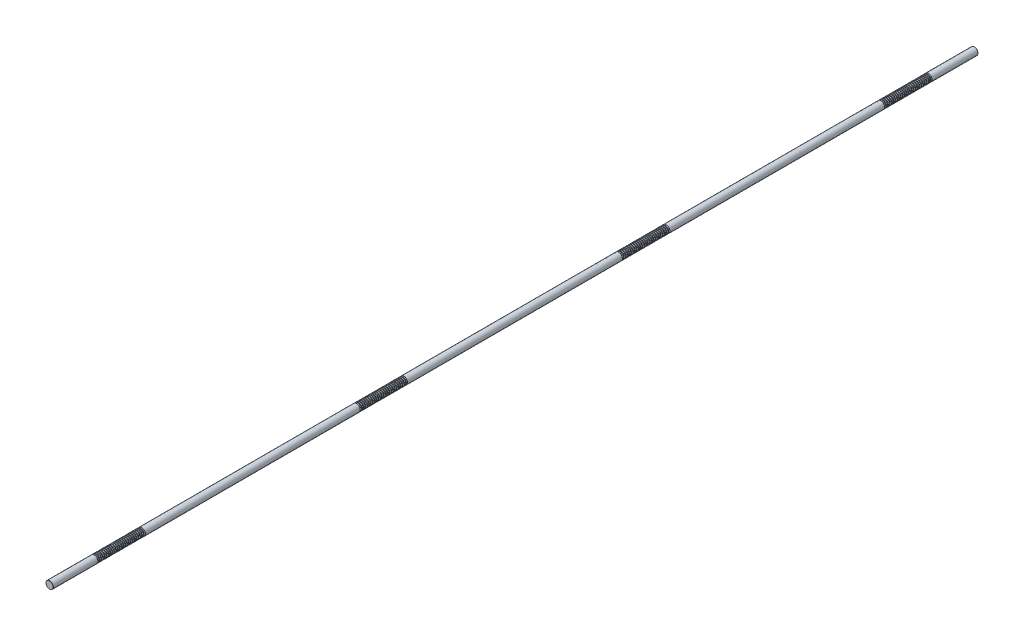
from build123d import *

# Parameters (mm, degrees)
SKETCH1_R           = 8
BOSS_EXTRUDE1_DEPTH = 1000
CHAMFER1_SIZE       = 0.4
LPATTERN1_COUNT     = 26
LPATTERN1_PITCH     = 4
LPATTERN2_COUNT     = 4
LPATTERN2_PITCH     = 567


with BuildPart() as part:
    # Sketch1 → Boss-Extrude1 (new, symmetric)
    with BuildSketch(Plane.XY):
        Circle(SKETCH1_R)
    extrude(amount=BOSS_EXTRUDE1_DEPTH, both=True)

    # Chamfer1
    chamfer1_edges = [part.edges().sort_by_distance(p)[0] for p in [
        (-8, 0, -1000),
        (-8, 0, 1000),
    ]]
    chamfer(chamfer1_edges, length=CHAMFER1_SIZE)

    # Sketch2 → Cut-Revolve1 (revolve, cut)
    with BuildSketch(Plane(origin=(0, 0, 0), x_dir=(0, 0, -1), z_dir=(1, 0, 0)), mode=Mode.PRIVATE) as cut_revolve1_sk:
        Polygon((900.301442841, 8), (897.698557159, 8), (898.301442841, 5.75), (899.698557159, 5.75), align=None)
    cut_revolve1 = revolve(cut_revolve1_sk.sketch.rotate(Axis((0, 0, 1000), (0, 0, -1)), 90), axis=Axis((0, 0, 1000), (0, 0, -1)), mode=Mode.SUBTRACT)

    # LPattern1: Cut-Revolve1 ×26
    with Locations(*[(0, 0, i * LPATTERN1_PITCH) for i in range(1, LPATTERN1_COUNT)]):
        add(cut_revolve1, mode=Mode.SUBTRACT)

    # LPattern2: Cut-Revolve1 ×4
    with Locations(*[(0, 0, i * LPATTERN2_PITCH) for i in range(1, LPATTERN2_COUNT)]):
        add(cut_revolve1, mode=Mode.SUBTRACT)

    # LPattern2 copy 1 sketch → LPattern2 copy 1 (revolve, cut)
    with BuildSketch(Plane(origin=(0, 0, 571), x_dir=(0, 0, -1), z_dir=(1, 0, 0))):
        Polygon((900.301442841, 8), (897.698557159, 8), (898.301442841, 5.75), (899.698557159, 5.75), align=None)
    revolve(axis=Axis((0, 0, 1571), (0, 0, -1)), mode=Mode.SUBTRACT)

    # LPattern2 copy 2 sketch → LPattern2 copy 2 (revolve, cut)
    with BuildSketch(Plane(origin=(0, 0, 1138), x_dir=(0, 0, -1), z_dir=(1, 0, 0))):
        Polygon((900.301442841, 8), (897.698557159, 8), (898.301442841, 5.75), (899.698557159, 5.75), align=None)
    revolve(axis=Axis((0, 0, 2138), (0, 0, -1)), mode=Mode.SUBTRACT)

    # LPattern2 copy 3 sketch → LPattern2 copy 3 (revolve, cut)
    with BuildSketch(Plane(origin=(0, 0, 1705), x_dir=(0, 0, -1), z_dir=(1, 0, 0))):
        Polygon((900.301442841, 8), (897.698557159, 8), (898.301442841, 5.75), (899.698557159, 5.75), align=None)
    revolve(axis=Axis((0, 0, 2705), (0, 0, -1)), mode=Mode.SUBTRACT)

    # LPattern2 copy 4 sketch → LPattern2 copy 4 (revolve, cut)
    with BuildSketch(Plane(origin=(0, 0, 575), x_dir=(0, 0, -1), z_dir=(1, 0, 0))):
        Polygon((900.301442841, 8), (897.698557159, 8), (898.301442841, 5.75), (899.698557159, 5.75), align=None)
    revolve(axis=Axis((0, 0, 1575), (0, 0, -1)), mode=Mode.SUBTRACT)

    # LPattern2 copy 5 sketch → LPattern2 copy 5 (revolve, cut)
    with BuildSketch(Plane(origin=(0, 0, 1142), x_dir=(0, 0, -1), z_dir=(1, 0, 0))):
        Polygon((900.301442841, 8), (897.698557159, 8), (898.301442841, 5.75), (899.698557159, 5.75), align=None)
    revolve(axis=Axis((0, 0, 2142), (0, 0, -1)), mode=Mode.SUBTRACT)

    # LPattern2 copy 6 sketch → LPattern2 copy 6 (revolve, cut)
    with BuildSketch(Plane(origin=(0, 0, 1709), x_dir=(0, 0, -1), z_dir=(1, 0, 0))):
        Polygon((900.301442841, 8), (897.698557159, 8), (898.301442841, 5.75), (899.698557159, 5.75), align=None)
    revolve(axis=Axis((0, 0, 2709), (0, 0, -1)), mode=Mode.SUBTRACT)

    # LPattern2 copy 7 sketch → LPattern2 copy 7 (revolve, cut)
    with BuildSketch(Plane(origin=(0, 0, 579), x_dir=(0, 0, -1), z_dir=(1, 0, 0))):
        Polygon((900.301442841, 8), (897.698557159, 8), (898.301442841, 5.75), (899.698557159, 5.75), align=None)
    revolve(axis=Axis((0, 0, 1579), (0, 0, -1)), mode=Mode.SUBTRACT)

    # LPattern2 copy 8 sketch → LPattern2 copy 8 (revolve, cut)
    with BuildSketch(Plane(origin=(0, 0, 1146), x_dir=(0, 0, -1), z_dir=(1, 0, 0))):
        Polygon((900.301442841, 8), (897.698557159, 8), (898.301442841, 5.75), (899.698557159, 5.75), align=None)
    revolve(axis=Axis((0, 0, 2146), (0, 0, -1)), mode=Mode.SUBTRACT)

    # LPattern2 copy 9 sketch → LPattern2 copy 9 (revolve, cut)
    with BuildSketch(Plane(origin=(0, 0, 1713), x_dir=(0, 0, -1), z_dir=(1, 0, 0))):
        Polygon((900.301442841, 8), (897.698557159, 8), (898.301442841, 5.75), (899.698557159, 5.75), align=None)
    revolve(axis=Axis((0, 0, 2713), (0, 0, -1)), mode=Mode.SUBTRACT)

    # LPattern2 copy 10 sketch → LPattern2 copy 10 (revolve, cut)
    with BuildSketch(Plane(origin=(0, 0, 583), x_dir=(0, 0, -1), z_dir=(1, 0, 0))):
        Polygon((900.301442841, 8), (897.698557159, 8), (898.301442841, 5.75), (899.698557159, 5.75), align=None)
    revolve(axis=Axis((0, 0, 1583), (0, 0, -1)), mode=Mode.SUBTRACT)

    # LPattern2 copy 11 sketch → LPattern2 copy 11 (revolve, cut)
    with BuildSketch(Plane(origin=(0, 0, 1150), x_dir=(0, 0, -1), z_dir=(1, 0, 0))):
        Polygon((900.301442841, 8), (897.698557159, 8), (898.301442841, 5.75), (899.698557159, 5.75), align=None)
    revolve(axis=Axis((0, 0, 2150), (0, 0, -1)), mode=Mode.SUBTRACT)

    # LPattern2 copy 12 sketch → LPattern2 copy 12 (revolve, cut)
    with BuildSketch(Plane(origin=(0, 0, 1717), x_dir=(0, 0, -1), z_dir=(1, 0, 0))):
        Polygon((900.301442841, 8), (897.698557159, 8), (898.301442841, 5.75), (899.698557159, 5.75), align=None)
    revolve(axis=Axis((0, 0, 2717), (0, 0, -1)), mode=Mode.SUBTRACT)

    # LPattern2 copy 13 sketch → LPattern2 copy 13 (revolve, cut)
    with BuildSketch(Plane(origin=(0, 0, 587), x_dir=(0, 0, -1), z_dir=(1, 0, 0))):
        Polygon((900.301442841, 8), (897.698557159, 8), (898.301442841, 5.75), (899.698557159, 5.75), align=None)
    revolve(axis=Axis((0, 0, 1587), (0, 0, -1)), mode=Mode.SUBTRACT)

    # LPattern2 copy 14 sketch → LPattern2 copy 14 (revolve, cut)
    with BuildSketch(Plane(origin=(0, 0, 1154), x_dir=(0, 0, -1), z_dir=(1, 0, 0))):
        Polygon((900.301442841, 8), (897.698557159, 8), (898.301442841, 5.75), (899.698557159, 5.75), align=None)
    revolve(axis=Axis((0, 0, 2154), (0, 0, -1)), mode=Mode.SUBTRACT)

    # LPattern2 copy 15 sketch → LPattern2 copy 15 (revolve, cut)
    with BuildSketch(Plane(origin=(0, 0, 1721), x_dir=(0, 0, -1), z_dir=(1, 0, 0))):
        Polygon((900.301442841, 8), (897.698557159, 8), (898.301442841, 5.75), (899.698557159, 5.75), align=None)
    revolve(axis=Axis((0, 0, 2721), (0, 0, -1)), mode=Mode.SUBTRACT)

    # LPattern2 copy 16 sketch → LPattern2 copy 16 (revolve, cut)
    with BuildSketch(Plane(origin=(0, 0, 591), x_dir=(0, 0, -1), z_dir=(1, 0, 0))):
        Polygon((900.301442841, 8), (897.698557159, 8), (898.301442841, 5.75), (899.698557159, 5.75), align=None)
    revolve(axis=Axis((0, 0, 1591), (0, 0, -1)), mode=Mode.SUBTRACT)

    # LPattern2 copy 17 sketch → LPattern2 copy 17 (revolve, cut)
    with BuildSketch(Plane(origin=(0, 0, 1158), x_dir=(0, 0, -1), z_dir=(1, 0, 0))):
        Polygon((900.301442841, 8), (897.698557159, 8), (898.301442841, 5.75), (899.698557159, 5.75), align=None)
    revolve(axis=Axis((0, 0, 2158), (0, 0, -1)), mode=Mode.SUBTRACT)

    # LPattern2 copy 18 sketch → LPattern2 copy 18 (revolve, cut)
    with BuildSketch(Plane(origin=(0, 0, 1725), x_dir=(0, 0, -1), z_dir=(1, 0, 0))):
        Polygon((900.301442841, 8), (897.698557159, 8), (898.301442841, 5.75), (899.698557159, 5.75), align=None)
    revolve(axis=Axis((0, 0, 2725), (0, 0, -1)), mode=Mode.SUBTRACT)

    # LPattern2 copy 19 sketch → LPattern2 copy 19 (revolve, cut)
    with BuildSketch(Plane(origin=(0, 0, 595), x_dir=(0, 0, -1), z_dir=(1, 0, 0))):
        Polygon((900.301442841, 8), (897.698557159, 8), (898.301442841, 5.75), (899.698557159, 5.75), align=None)
    revolve(axis=Axis((0, 0, 1595), (0, 0, -1)), mode=Mode.SUBTRACT)

    # LPattern2 copy 20 sketch → LPattern2 copy 20 (revolve, cut)
    with BuildSketch(Plane(origin=(0, 0, 1162), x_dir=(0, 0, -1), z_dir=(1, 0, 0))):
        Polygon((900.301442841, 8), (897.698557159, 8), (898.301442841, 5.75), (899.698557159, 5.75), align=None)
    revolve(axis=Axis((0, 0, 2162), (0, 0, -1)), mode=Mode.SUBTRACT)

    # LPattern2 copy 21 sketch → LPattern2 copy 21 (revolve, cut)
    with BuildSketch(Plane(origin=(0, 0, 1729), x_dir=(0, 0, -1), z_dir=(1, 0, 0))):
        Polygon((900.301442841, 8), (897.698557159, 8), (898.301442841, 5.75), (899.698557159, 5.75), align=None)
    revolve(axis=Axis((0, 0, 2729), (0, 0, -1)), mode=Mode.SUBTRACT)

    # LPattern2 copy 22 sketch → LPattern2 copy 22 (revolve, cut)
    with BuildSketch(Plane(origin=(0, 0, 599), x_dir=(0, 0, -1), z_dir=(1, 0, 0))):
        Polygon((900.301442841, 8), (897.698557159, 8), (898.301442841, 5.75), (899.698557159, 5.75), align=None)
    revolve(axis=Axis((0, 0, 1599), (0, 0, -1)), mode=Mode.SUBTRACT)

    # LPattern2 copy 23 sketch → LPattern2 copy 23 (revolve, cut)
    with BuildSketch(Plane(origin=(0, 0, 1166), x_dir=(0, 0, -1), z_dir=(1, 0, 0))):
        Polygon((900.301442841, 8), (897.698557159, 8), (898.301442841, 5.75), (899.698557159, 5.75), align=None)
    revolve(axis=Axis((0, 0, 2166), (0, 0, -1)), mode=Mode.SUBTRACT)

    # LPattern2 copy 24 sketch → LPattern2 copy 24 (revolve, cut)
    with BuildSketch(Plane(origin=(0, 0, 1733), x_dir=(0, 0, -1), z_dir=(1, 0, 0))):
        Polygon((900.301442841, 8), (897.698557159, 8), (898.301442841, 5.75), (899.698557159, 5.75), align=None)
    revolve(axis=Axis((0, 0, 2733), (0, 0, -1)), mode=Mode.SUBTRACT)

    # LPattern2 copy 25 sketch → LPattern2 copy 25 (revolve, cut)
    with BuildSketch(Plane(origin=(0, 0, 603), x_dir=(0, 0, -1), z_dir=(1, 0, 0))):
        Polygon((900.301442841, 8), (897.698557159, 8), (898.301442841, 5.75), (899.698557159, 5.75), align=None)
    revolve(axis=Axis((0, 0, 1603), (0, 0, -1)), mode=Mode.SUBTRACT)

    # LPattern2 copy 26 sketch → LPattern2 copy 26 (revolve, cut)
    with BuildSketch(Plane(origin=(0, 0, 1170), x_dir=(0, 0, -1), z_dir=(1, 0, 0))):
        Polygon((900.301442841, 8), (897.698557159, 8), (898.301442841, 5.75), (899.698557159, 5.75), align=None)
    revolve(axis=Axis((0, 0, 2170), (0, 0, -1)), mode=Mode.SUBTRACT)

    # LPattern2 copy 27 sketch → LPattern2 copy 27 (revolve, cut)
    with BuildSketch(Plane(origin=(0, 0, 1737), x_dir=(0, 0, -1), z_dir=(1, 0, 0))):
        Polygon((900.301442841, 8), (897.698557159, 8), (898.301442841, 5.75), (899.698557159, 5.75), align=None)
    revolve(axis=Axis((0, 0, 2737), (0, 0, -1)), mode=Mode.SUBTRACT)

    # LPattern2 copy 28 sketch → LPattern2 copy 28 (revolve, cut)
    with BuildSketch(Plane(origin=(0, 0, 607), x_dir=(0, 0, -1), z_dir=(1, 0, 0))):
        Polygon((900.301442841, 8), (897.698557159, 8), (898.301442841, 5.75), (899.698557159, 5.75), align=None)
    revolve(axis=Axis((0, 0, 1607), (0, 0, -1)), mode=Mode.SUBTRACT)

    # LPattern2 copy 29 sketch → LPattern2 copy 29 (revolve, cut)
    with BuildSketch(Plane(origin=(0, 0, 1174), x_dir=(0, 0, -1), z_dir=(1, 0, 0))):
        Polygon((900.301442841, 8), (897.698557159, 8), (898.301442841, 5.75), (899.698557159, 5.75), align=None)
    revolve(axis=Axis((0, 0, 2174), (0, 0, -1)), mode=Mode.SUBTRACT)

    # LPattern2 copy 30 sketch → LPattern2 copy 30 (revolve, cut)
    with BuildSketch(Plane(origin=(0, 0, 1741), x_dir=(0, 0, -1), z_dir=(1, 0, 0))):
        Polygon((900.301442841, 8), (897.698557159, 8), (898.301442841, 5.75), (899.698557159, 5.75), align=None)
    revolve(axis=Axis((0, 0, 2741), (0, 0, -1)), mode=Mode.SUBTRACT)

    # LPattern2 copy 31 sketch → LPattern2 copy 31 (revolve, cut)
    with BuildSketch(Plane(origin=(0, 0, 611), x_dir=(0, 0, -1), z_dir=(1, 0, 0))):
        Polygon((900.301442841, 8), (897.698557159, 8), (898.301442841, 5.75), (899.698557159, 5.75), align=None)
    revolve(axis=Axis((0, 0, 1611), (0, 0, -1)), mode=Mode.SUBTRACT)

    # LPattern2 copy 32 sketch → LPattern2 copy 32 (revolve, cut)
    with BuildSketch(Plane(origin=(0, 0, 1178), x_dir=(0, 0, -1), z_dir=(1, 0, 0))):
        Polygon((900.301442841, 8), (897.698557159, 8), (898.301442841, 5.75), (899.698557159, 5.75), align=None)
    revolve(axis=Axis((0, 0, 2178), (0, 0, -1)), mode=Mode.SUBTRACT)

    # LPattern2 copy 33 sketch → LPattern2 copy 33 (revolve, cut)
    with BuildSketch(Plane(origin=(0, 0, 1745), x_dir=(0, 0, -1), z_dir=(1, 0, 0))):
        Polygon((900.301442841, 8), (897.698557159, 8), (898.301442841, 5.75), (899.698557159, 5.75), align=None)
    revolve(axis=Axis((0, 0, 2745), (0, 0, -1)), mode=Mode.SUBTRACT)

    # LPattern2 copy 34 sketch → LPattern2 copy 34 (revolve, cut)
    with BuildSketch(Plane(origin=(0, 0, 615), x_dir=(0, 0, -1), z_dir=(1, 0, 0))):
        Polygon((900.301442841, 8), (897.698557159, 8), (898.301442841, 5.75), (899.698557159, 5.75), align=None)
    revolve(axis=Axis((0, 0, 1615), (0, 0, -1)), mode=Mode.SUBTRACT)

    # LPattern2 copy 35 sketch → LPattern2 copy 35 (revolve, cut)
    with BuildSketch(Plane(origin=(0, 0, 1182), x_dir=(0, 0, -1), z_dir=(1, 0, 0))):
        Polygon((900.301442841, 8), (897.698557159, 8), (898.301442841, 5.75), (899.698557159, 5.75), align=None)
    revolve(axis=Axis((0, 0, 2182), (0, 0, -1)), mode=Mode.SUBTRACT)

    # LPattern2 copy 36 sketch → LPattern2 copy 36 (revolve, cut)
    with BuildSketch(Plane(origin=(0, 0, 1749), x_dir=(0, 0, -1), z_dir=(1, 0, 0))):
        Polygon((900.301442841, 8), (897.698557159, 8), (898.301442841, 5.75), (899.698557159, 5.75), align=None)
    revolve(axis=Axis((0, 0, 2749), (0, 0, -1)), mode=Mode.SUBTRACT)

    # LPattern2 copy 37 sketch → LPattern2 copy 37 (revolve, cut)
    with BuildSketch(Plane(origin=(0, 0, 619), x_dir=(0, 0, -1), z_dir=(1, 0, 0))):
        Polygon((900.301442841, 8), (897.698557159, 8), (898.301442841, 5.75), (899.698557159, 5.75), align=None)
    revolve(axis=Axis((0, 0, 1619), (0, 0, -1)), mode=Mode.SUBTRACT)

    # LPattern2 copy 38 sketch → LPattern2 copy 38 (revolve, cut)
    with BuildSketch(Plane(origin=(0, 0, 1186), x_dir=(0, 0, -1), z_dir=(1, 0, 0))):
        Polygon((900.301442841, 8), (897.698557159, 8), (898.301442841, 5.75), (899.698557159, 5.75), align=None)
    revolve(axis=Axis((0, 0, 2186), (0, 0, -1)), mode=Mode.SUBTRACT)

    # LPattern2 copy 39 sketch → LPattern2 copy 39 (revolve, cut)
    with BuildSketch(Plane(origin=(0, 0, 1753), x_dir=(0, 0, -1), z_dir=(1, 0, 0))):
        Polygon((900.301442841, 8), (897.698557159, 8), (898.301442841, 5.75), (899.698557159, 5.75), align=None)
    revolve(axis=Axis((0, 0, 2753), (0, 0, -1)), mode=Mode.SUBTRACT)

    # LPattern2 copy 40 sketch → LPattern2 copy 40 (revolve, cut)
    with BuildSketch(Plane(origin=(0, 0, 623), x_dir=(0, 0, -1), z_dir=(1, 0, 0))):
        Polygon((900.301442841, 8), (897.698557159, 8), (898.301442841, 5.75), (899.698557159, 5.75), align=None)
    revolve(axis=Axis((0, 0, 1623), (0, 0, -1)), mode=Mode.SUBTRACT)

    # LPattern2 copy 41 sketch → LPattern2 copy 41 (revolve, cut)
    with BuildSketch(Plane(origin=(0, 0, 1190), x_dir=(0, 0, -1), z_dir=(1, 0, 0))):
        Polygon((900.301442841, 8), (897.698557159, 8), (898.301442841, 5.75), (899.698557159, 5.75), align=None)
    revolve(axis=Axis((0, 0, 2190), (0, 0, -1)), mode=Mode.SUBTRACT)

    # LPattern2 copy 42 sketch → LPattern2 copy 42 (revolve, cut)
    with BuildSketch(Plane(origin=(0, 0, 1757), x_dir=(0, 0, -1), z_dir=(1, 0, 0))):
        Polygon((900.301442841, 8), (897.698557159, 8), (898.301442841, 5.75), (899.698557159, 5.75), align=None)
    revolve(axis=Axis((0, 0, 2757), (0, 0, -1)), mode=Mode.SUBTRACT)

    # LPattern2 copy 43 sketch → LPattern2 copy 43 (revolve, cut)
    with BuildSketch(Plane(origin=(0, 0, 627), x_dir=(0, 0, -1), z_dir=(1, 0, 0))):
        Polygon((900.301442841, 8), (897.698557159, 8), (898.301442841, 5.75), (899.698557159, 5.75), align=None)
    revolve(axis=Axis((0, 0, 1627), (0, 0, -1)), mode=Mode.SUBTRACT)

    # LPattern2 copy 44 sketch → LPattern2 copy 44 (revolve, cut)
    with BuildSketch(Plane(origin=(0, 0, 1194), x_dir=(0, 0, -1), z_dir=(1, 0, 0))):
        Polygon((900.301442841, 8), (897.698557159, 8), (898.301442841, 5.75), (899.698557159, 5.75), align=None)
    revolve(axis=Axis((0, 0, 2194), (0, 0, -1)), mode=Mode.SUBTRACT)

    # LPattern2 copy 45 sketch → LPattern2 copy 45 (revolve, cut)
    with BuildSketch(Plane(origin=(0, 0, 1761), x_dir=(0, 0, -1), z_dir=(1, 0, 0))):
        Polygon((900.301442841, 8), (897.698557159, 8), (898.301442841, 5.75), (899.698557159, 5.75), align=None)
    revolve(axis=Axis((0, 0, 2761), (0, 0, -1)), mode=Mode.SUBTRACT)

    # LPattern2 copy 46 sketch → LPattern2 copy 46 (revolve, cut)
    with BuildSketch(Plane(origin=(0, 0, 631), x_dir=(0, 0, -1), z_dir=(1, 0, 0))):
        Polygon((900.301442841, 8), (897.698557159, 8), (898.301442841, 5.75), (899.698557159, 5.75), align=None)
    revolve(axis=Axis((0, 0, 1631), (0, 0, -1)), mode=Mode.SUBTRACT)

    # LPattern2 copy 47 sketch → LPattern2 copy 47 (revolve, cut)
    with BuildSketch(Plane(origin=(0, 0, 1198), x_dir=(0, 0, -1), z_dir=(1, 0, 0))):
        Polygon((900.301442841, 8), (897.698557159, 8), (898.301442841, 5.75), (899.698557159, 5.75), align=None)
    revolve(axis=Axis((0, 0, 2198), (0, 0, -1)), mode=Mode.SUBTRACT)

    # LPattern2 copy 48 sketch → LPattern2 copy 48 (revolve, cut)
    with BuildSketch(Plane(origin=(0, 0, 1765), x_dir=(0, 0, -1), z_dir=(1, 0, 0))):
        Polygon((900.301442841, 8), (897.698557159, 8), (898.301442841, 5.75), (899.698557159, 5.75), align=None)
    revolve(axis=Axis((0, 0, 2765), (0, 0, -1)), mode=Mode.SUBTRACT)

    # LPattern2 copy 49 sketch → LPattern2 copy 49 (revolve, cut)
    with BuildSketch(Plane(origin=(0, 0, 635), x_dir=(0, 0, -1), z_dir=(1, 0, 0))):
        Polygon((900.301442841, 8), (897.698557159, 8), (898.301442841, 5.75), (899.698557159, 5.75), align=None)
    revolve(axis=Axis((0, 0, 1635), (0, 0, -1)), mode=Mode.SUBTRACT)

    # LPattern2 copy 50 sketch → LPattern2 copy 50 (revolve, cut)
    with BuildSketch(Plane(origin=(0, 0, 1202), x_dir=(0, 0, -1), z_dir=(1, 0, 0))):
        Polygon((900.301442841, 8), (897.698557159, 8), (898.301442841, 5.75), (899.698557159, 5.75), align=None)
    revolve(axis=Axis((0, 0, 2202), (0, 0, -1)), mode=Mode.SUBTRACT)

    # LPattern2 copy 51 sketch → LPattern2 copy 51 (revolve, cut)
    with BuildSketch(Plane(origin=(0, 0, 1769), x_dir=(0, 0, -1), z_dir=(1, 0, 0))):
        Polygon((900.301442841, 8), (897.698557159, 8), (898.301442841, 5.75), (899.698557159, 5.75), align=None)
    revolve(axis=Axis((0, 0, 2769), (0, 0, -1)), mode=Mode.SUBTRACT)

    # LPattern2 copy 52 sketch → LPattern2 copy 52 (revolve, cut)
    with BuildSketch(Plane(origin=(0, 0, 639), x_dir=(0, 0, -1), z_dir=(1, 0, 0))):
        Polygon((900.301442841, 8), (897.698557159, 8), (898.301442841, 5.75), (899.698557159, 5.75), align=None)
    revolve(axis=Axis((0, 0, 1639), (0, 0, -1)), mode=Mode.SUBTRACT)

    # LPattern2 copy 53 sketch → LPattern2 copy 53 (revolve, cut)
    with BuildSketch(Plane(origin=(0, 0, 1206), x_dir=(0, 0, -1), z_dir=(1, 0, 0))):
        Polygon((900.301442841, 8), (897.698557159, 8), (898.301442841, 5.75), (899.698557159, 5.75), align=None)
    revolve(axis=Axis((0, 0, 2206), (0, 0, -1)), mode=Mode.SUBTRACT)

    # LPattern2 copy 54 sketch → LPattern2 copy 54 (revolve, cut)
    with BuildSketch(Plane(origin=(0, 0, 1773), x_dir=(0, 0, -1), z_dir=(1, 0, 0))):
        Polygon((900.301442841, 8), (897.698557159, 8), (898.301442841, 5.75), (899.698557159, 5.75), align=None)
    revolve(axis=Axis((0, 0, 2773), (0, 0, -1)), mode=Mode.SUBTRACT)

    # LPattern2 copy 55 sketch → LPattern2 copy 55 (revolve, cut)
    with BuildSketch(Plane(origin=(0, 0, 643), x_dir=(0, 0, -1), z_dir=(1, 0, 0))):
        Polygon((900.301442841, 8), (897.698557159, 8), (898.301442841, 5.75), (899.698557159, 5.75), align=None)
    revolve(axis=Axis((0, 0, 1643), (0, 0, -1)), mode=Mode.SUBTRACT)

    # LPattern2 copy 56 sketch → LPattern2 copy 56 (revolve, cut)
    with BuildSketch(Plane(origin=(0, 0, 1210), x_dir=(0, 0, -1), z_dir=(1, 0, 0))):
        Polygon((900.301442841, 8), (897.698557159, 8), (898.301442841, 5.75), (899.698557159, 5.75), align=None)
    revolve(axis=Axis((0, 0, 2210), (0, 0, -1)), mode=Mode.SUBTRACT)

    # LPattern2 copy 57 sketch → LPattern2 copy 57 (revolve, cut)
    with BuildSketch(Plane(origin=(0, 0, 1777), x_dir=(0, 0, -1), z_dir=(1, 0, 0))):
        Polygon((900.301442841, 8), (897.698557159, 8), (898.301442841, 5.75), (899.698557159, 5.75), align=None)
    revolve(axis=Axis((0, 0, 2777), (0, 0, -1)), mode=Mode.SUBTRACT)

    # LPattern2 copy 58 sketch → LPattern2 copy 58 (revolve, cut)
    with BuildSketch(Plane(origin=(0, 0, 647), x_dir=(0, 0, -1), z_dir=(1, 0, 0))):
        Polygon((900.301442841, 8), (897.698557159, 8), (898.301442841, 5.75), (899.698557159, 5.75), align=None)
    revolve(axis=Axis((0, 0, 1647), (0, 0, -1)), mode=Mode.SUBTRACT)

    # LPattern2 copy 59 sketch → LPattern2 copy 59 (revolve, cut)
    with BuildSketch(Plane(origin=(0, 0, 1214), x_dir=(0, 0, -1), z_dir=(1, 0, 0))):
        Polygon((900.301442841, 8), (897.698557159, 8), (898.301442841, 5.75), (899.698557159, 5.75), align=None)
    revolve(axis=Axis((0, 0, 2214), (0, 0, -1)), mode=Mode.SUBTRACT)

    # LPattern2 copy 60 sketch → LPattern2 copy 60 (revolve, cut)
    with BuildSketch(Plane(origin=(0, 0, 1781), x_dir=(0, 0, -1), z_dir=(1, 0, 0))):
        Polygon((900.301442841, 8), (897.698557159, 8), (898.301442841, 5.75), (899.698557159, 5.75), align=None)
    revolve(axis=Axis((0, 0, 2781), (0, 0, -1)), mode=Mode.SUBTRACT)

    # LPattern2 copy 61 sketch → LPattern2 copy 61 (revolve, cut)
    with BuildSketch(Plane(origin=(0, 0, 651), x_dir=(0, 0, -1), z_dir=(1, 0, 0))):
        Polygon((900.301442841, 8), (897.698557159, 8), (898.301442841, 5.75), (899.698557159, 5.75), align=None)
    revolve(axis=Axis((0, 0, 1651), (0, 0, -1)), mode=Mode.SUBTRACT)

    # LPattern2 copy 62 sketch → LPattern2 copy 62 (revolve, cut)
    with BuildSketch(Plane(origin=(0, 0, 1218), x_dir=(0, 0, -1), z_dir=(1, 0, 0))):
        Polygon((900.301442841, 8), (897.698557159, 8), (898.301442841, 5.75), (899.698557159, 5.75), align=None)
    revolve(axis=Axis((0, 0, 2218), (0, 0, -1)), mode=Mode.SUBTRACT)

    # LPattern2 copy 63 sketch → LPattern2 copy 63 (revolve, cut)
    with BuildSketch(Plane(origin=(0, 0, 1785), x_dir=(0, 0, -1), z_dir=(1, 0, 0))):
        Polygon((900.301442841, 8), (897.698557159, 8), (898.301442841, 5.75), (899.698557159, 5.75), align=None)
    revolve(axis=Axis((0, 0, 2785), (0, 0, -1)), mode=Mode.SUBTRACT)

    # LPattern2 copy 64 sketch → LPattern2 copy 64 (revolve, cut)
    with BuildSketch(Plane(origin=(0, 0, 655), x_dir=(0, 0, -1), z_dir=(1, 0, 0))):
        Polygon((900.301442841, 8), (897.698557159, 8), (898.301442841, 5.75), (899.698557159, 5.75), align=None)
    revolve(axis=Axis((0, 0, 1655), (0, 0, -1)), mode=Mode.SUBTRACT)

    # LPattern2 copy 65 sketch → LPattern2 copy 65 (revolve, cut)
    with BuildSketch(Plane(origin=(0, 0, 1222), x_dir=(0, 0, -1), z_dir=(1, 0, 0))):
        Polygon((900.301442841, 8), (897.698557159, 8), (898.301442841, 5.75), (899.698557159, 5.75), align=None)
    revolve(axis=Axis((0, 0, 2222), (0, 0, -1)), mode=Mode.SUBTRACT)

    # LPattern2 copy 66 sketch → LPattern2 copy 66 (revolve, cut)
    with BuildSketch(Plane(origin=(0, 0, 1789), x_dir=(0, 0, -1), z_dir=(1, 0, 0))):
        Polygon((900.301442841, 8), (897.698557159, 8), (898.301442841, 5.75), (899.698557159, 5.75), align=None)
    revolve(axis=Axis((0, 0, 2789), (0, 0, -1)), mode=Mode.SUBTRACT)

    # LPattern2 copy 67 sketch → LPattern2 copy 67 (revolve, cut)
    with BuildSketch(Plane(origin=(0, 0, 659), x_dir=(0, 0, -1), z_dir=(1, 0, 0))):
        Polygon((900.301442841, 8), (897.698557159, 8), (898.301442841, 5.75), (899.698557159, 5.75), align=None)
    revolve(axis=Axis((0, 0, 1659), (0, 0, -1)), mode=Mode.SUBTRACT)

    # LPattern2 copy 68 sketch → LPattern2 copy 68 (revolve, cut)
    with BuildSketch(Plane(origin=(0, 0, 1226), x_dir=(0, 0, -1), z_dir=(1, 0, 0))):
        Polygon((900.301442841, 8), (897.698557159, 8), (898.301442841, 5.75), (899.698557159, 5.75), align=None)
    revolve(axis=Axis((0, 0, 2226), (0, 0, -1)), mode=Mode.SUBTRACT)

    # LPattern2 copy 69 sketch → LPattern2 copy 69 (revolve, cut)
    with BuildSketch(Plane(origin=(0, 0, 1793), x_dir=(0, 0, -1), z_dir=(1, 0, 0))):
        Polygon((900.301442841, 8), (897.698557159, 8), (898.301442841, 5.75), (899.698557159, 5.75), align=None)
    revolve(axis=Axis((0, 0, 2793), (0, 0, -1)), mode=Mode.SUBTRACT)

    # LPattern2 copy 70 sketch → LPattern2 copy 70 (revolve, cut)
    with BuildSketch(Plane(origin=(0, 0, 663), x_dir=(0, 0, -1), z_dir=(1, 0, 0))):
        Polygon((900.301442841, 8), (897.698557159, 8), (898.301442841, 5.75), (899.698557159, 5.75), align=None)
    revolve(axis=Axis((0, 0, 1663), (0, 0, -1)), mode=Mode.SUBTRACT)

    # LPattern2 copy 71 sketch → LPattern2 copy 71 (revolve, cut)
    with BuildSketch(Plane(origin=(0, 0, 1230), x_dir=(0, 0, -1), z_dir=(1, 0, 0))):
        Polygon((900.301442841, 8), (897.698557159, 8), (898.301442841, 5.75), (899.698557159, 5.75), align=None)
    revolve(axis=Axis((0, 0, 2230), (0, 0, -1)), mode=Mode.SUBTRACT)

    # LPattern2 copy 72 sketch → LPattern2 copy 72 (revolve, cut)
    with BuildSketch(Plane(origin=(0, 0, 1797), x_dir=(0, 0, -1), z_dir=(1, 0, 0))):
        Polygon((900.301442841, 8), (897.698557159, 8), (898.301442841, 5.75), (899.698557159, 5.75), align=None)
    revolve(axis=Axis((0, 0, 2797), (0, 0, -1)), mode=Mode.SUBTRACT)

    # LPattern2 copy 73 sketch → LPattern2 copy 73 (revolve, cut)
    with BuildSketch(Plane(origin=(0, 0, 667), x_dir=(0, 0, -1), z_dir=(1, 0, 0))):
        Polygon((900.301442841, 8), (897.698557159, 8), (898.301442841, 5.75), (899.698557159, 5.75), align=None)
    revolve(axis=Axis((0, 0, 1667), (0, 0, -1)), mode=Mode.SUBTRACT)

    # LPattern2 copy 74 sketch → LPattern2 copy 74 (revolve, cut)
    with BuildSketch(Plane(origin=(0, 0, 1234), x_dir=(0, 0, -1), z_dir=(1, 0, 0))):
        Polygon((900.301442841, 8), (897.698557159, 8), (898.301442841, 5.75), (899.698557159, 5.75), align=None)
    revolve(axis=Axis((0, 0, 2234), (0, 0, -1)), mode=Mode.SUBTRACT)

    # LPattern2 copy 75 sketch → LPattern2 copy 75 (revolve, cut)
    with BuildSketch(Plane(origin=(0, 0, 1801), x_dir=(0, 0, -1), z_dir=(1, 0, 0))):
        Polygon((900.301442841, 8), (897.698557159, 8), (898.301442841, 5.75), (899.698557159, 5.75), align=None)
    revolve(axis=Axis((0, 0, 2801), (0, 0, -1)), mode=Mode.SUBTRACT)


solid = part.part
